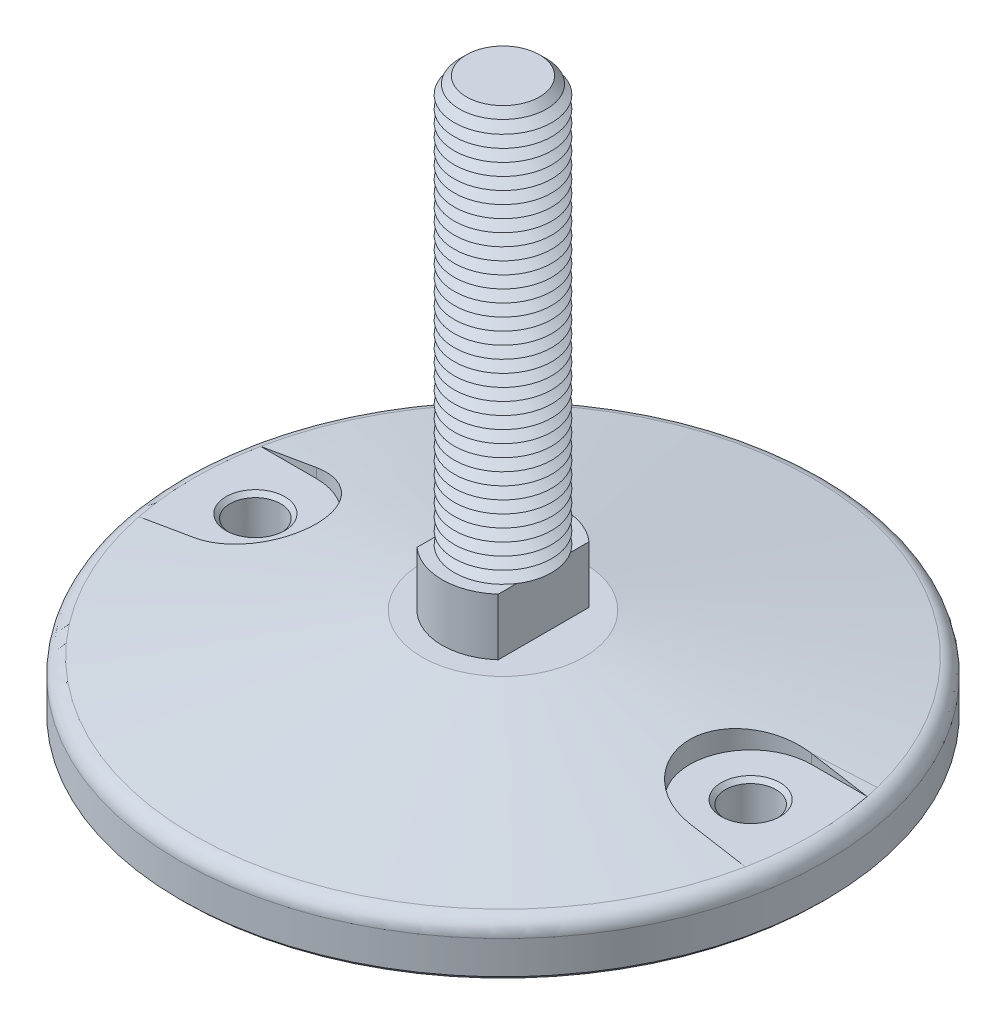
from build123d import *

# Parameters (mm, degrees)
FILLET1_R                = 4
SKETCH3_R                = 15
BOSS_EXTRUDE1_DEPTH      = 14
CUT_EXTRUDE1_START       = -14
CUT_EXTRUDE1_DEPTH       = 14
SKETCH5_R                = 12
BOSS_EXTRUDE2_DEPTH      = 100
CHAMFER1_SIZE            = 3
LPATTERN1_COUNT          = 33
LPATTERN1_PITCH          = 3
CUT_EXTRUDE4_DEPTH       = 9.91
SKETCH10_R               = 6.25
CUT_EXTRUDE5_DEPTH       = 13.09
CHAMFER2_SIZE            = 1
CHAMFER2_OF_MIRROR1_SIZE = 1
CHAMFER3_SIZE            = 1


with BuildPart() as part:
    # Sketch2 → Revolve1 (revolve)
    with BuildSketch(Plane(origin=(0, 0, 0), x_dir=(0, 0, -1), z_dir=(1, 0, 0)), mode=Mode.PRIVATE) as revolve1_sk:
        Polygon((0, 0), (-20, 0), (-79.5, -10.491455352), (-79.5, -23), (0, -23), align=None)
    revolve(revolve1_sk.sketch.rotate(Axis((0, 61.338865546, 0), (0, -1, 0)), 180), axis=Axis((0, 61.338865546, 0), (0, -1, 0)))

    # Fillet1
    fillet1_edges = [part.edges().sort_by_distance(p)[0] for p in [
        (0, -10.491455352, 79.5),
    ]]
    fillet(fillet1_edges, radius=FILLET1_R)

    # Sketch3 → Boss-Extrude1 (add)
    with BuildSketch(Plane(origin=(0, 0, 0), x_dir=(1, 0, 0), z_dir=(0, 1, 0))):
        with Locations(Location((0, 0, 0), (0, 0, 270))):
            Circle(SKETCH3_R)
    extrude(amount=BOSS_EXTRUDE1_DEPTH)

    # Sketch4 → Cut-Extrude1 (cut)
    with BuildSketch(Plane(origin=(0, 14, 0), x_dir=(1, 0, 0), z_dir=(0, 1, 0)).offset(CUT_EXTRUDE1_START)):
        with BuildLine():
            Line((-10, 11.180339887), (-10, -11.180339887))
            ThreePointArc((-10, -11.180339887), (-15, 0), (-10, 11.180339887))
        make_face()
        with BuildLine():
            Line((10, -11.180339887), (10, 11.180339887))
            ThreePointArc((10, 11.180339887), (15, 0), (10, -11.180339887))
        make_face()
    extrude(amount=CUT_EXTRUDE1_DEPTH, mode=Mode.SUBTRACT)

    # Sketch5 → Boss-Extrude2 (add)
    with BuildSketch(Plane(origin=(0, 14, 0), x_dir=(1, 0, 0), z_dir=(0, 1, 0))):
        with Locations(Location((0, 0, 0), (0, 0, 33.557309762))):
            Circle(SKETCH5_R)
    extrude(amount=BOSS_EXTRUDE2_DEPTH)

    # Chamfer1
    chamfer1_edges = [part.edges().sort_by_distance(p)[0] for p in [
        (-10, 114, 6.633249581),
    ]]
    chamfer(chamfer1_edges, length=CHAMFER1_SIZE)

    # Sketch6 → Cut-Revolve1 (revolve, cut)
    with BuildSketch(Plane(origin=(0, 0, 0), x_dir=(0, 0, -1), z_dir=(1, 0, 0)), mode=Mode.PRIVATE) as cut_revolve1_sk:
        Polygon((-12, 14), (-9.401923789, 15.5), (-12, 17), align=None)
    cut_revolve1 = revolve(cut_revolve1_sk.sketch.rotate(Axis((0, 61.338865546, 0), (0, -1, 0)), 180), axis=Axis((0, 61.338865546, 0), (0, -1, 0)), mode=Mode.SUBTRACT)

    # LPattern1: Cut-Revolve1 ×33
    with Locations(*[(0, i * LPATTERN1_PITCH, 0) for i in range(1, LPATTERN1_COUNT)]):
        add(cut_revolve1, mode=Mode.SUBTRACT)

    # Sketch8 → Cut-Extrude4 (cut)
    with BuildSketch(Plane(origin=(0, 0, 0), x_dir=(1, 0, 0), z_dir=(0, 1, 0))):
        with BuildLine():
            Line((-61, 15), (-74.703520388, 15))
            ThreePointArc((-74.703520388, 15), (-76.194592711, 0), (-74.703520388, -15))
            Line((-74.703520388, -15), (-61, -15))
            ThreePointArc((-61, -15), (-46, 0), (-61, 15))
        make_face()
    cut_extrude4 = extrude(amount=-CUT_EXTRUDE4_DEPTH, mode=Mode.SUBTRACT)

    # Sketch10 → Cut-Extrude5 (cut)
    with BuildSketch(Plane(origin=(0, -9.91, 0), x_dir=(1, 0, 0), z_dir=(0, 1, 0))):
        with Locations(Location((-61, 0, 0), (0, 0, 270))):
            Circle(SKETCH10_R)
    cut_extrude5 = extrude(amount=-CUT_EXTRUDE5_DEPTH, mode=Mode.SUBTRACT)

    # Chamfer2
    chamfer2_edges = [part.edges().sort_by_distance(p)[0] for p in [
        (-61, -9.91, -6.25),
        (-61, -23, -6.25),
    ]]
    chamfer(chamfer2_edges, length=CHAMFER2_SIZE)

    # Mirror1: Cut-Extrude4, Cut-Extrude5 across plane
    add(cut_extrude4.mirror(Plane(origin=(0, 0, 0), x_dir=(0, 0, 1), z_dir=(1, 0, 0))), mode=Mode.SUBTRACT)
    add(cut_extrude5.mirror(Plane(origin=(0, 0, 0), x_dir=(0, 0, 1), z_dir=(1, 0, 0))), mode=Mode.SUBTRACT)

    # Chamfer2 of Mirror1
    chamfer2_of_mirror1_edges = [part.edges().sort_by_distance(p)[0] for p in [
        (61, -9.91, -6.25),
        (61, -23, -6.25),
    ]]
    chamfer(chamfer2_of_mirror1_edges, length=CHAMFER2_OF_MIRROR1_SIZE)

    # Chamfer3
    chamfer3_edges = [part.edges().sort_by_distance(p)[0] for p in [
        (0, -23, 79.5),
    ]]
    chamfer(chamfer3_edges, length=CHAMFER3_SIZE)


solid = part.part
